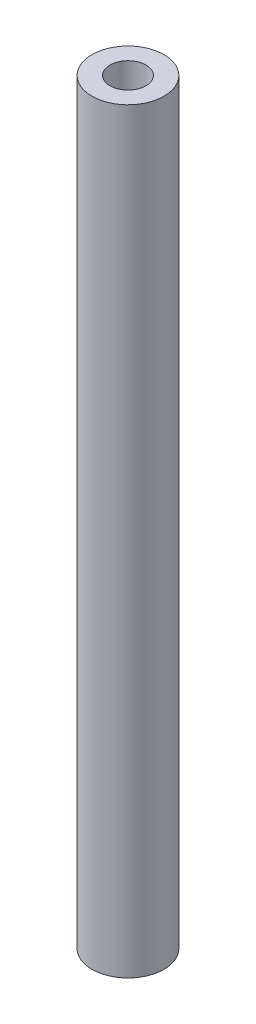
ISO-10303-21;
HEADER;
FILE_DESCRIPTION(('STEP AP214'),'2;1');
FILE_NAME('part.step','',(''),(''),'','','');
FILE_SCHEMA(('AUTOMOTIVE_DESIGN { 1 0 10303 214 1 1 1 1 }'));
ENDSEC;
DATA;
#1=APPLICATION_CONTEXT('core data for automotive mechanical design processes');
#2=APPLICATION_PROTOCOL_DEFINITION('international standard','automotive_design',2000,#1);
#3=PRODUCT_CONTEXT('',#1,'mechanical');
#4=PRODUCT('Part','Part','',(#3));
#5=PRODUCT_RELATED_PRODUCT_CATEGORY('part','',(#4));
#6=PRODUCT_DEFINITION_FORMATION('','',#4);
#7=PRODUCT_DEFINITION_CONTEXT('part definition',#1,'design');
#8=PRODUCT_DEFINITION('design','',#6,#7);
#9=PRODUCT_DEFINITION_SHAPE('','',#8);
#10=(LENGTH_UNIT() NAMED_UNIT(*) SI_UNIT(.MILLI.,.METRE.));
#11=(NAMED_UNIT(*) PLANE_ANGLE_UNIT() SI_UNIT($,.RADIAN.));
#12=(NAMED_UNIT(*) SI_UNIT($,.STERADIAN.) SOLID_ANGLE_UNIT());
#13=UNCERTAINTY_MEASURE_WITH_UNIT(LENGTH_MEASURE(1.E-05),#10,'distance_accuracy_value','');
#14=(GEOMETRIC_REPRESENTATION_CONTEXT(3) GLOBAL_UNCERTAINTY_ASSIGNED_CONTEXT((#13)) GLOBAL_UNIT_ASSIGNED_CONTEXT((#10,
#11,#12)) REPRESENTATION_CONTEXT('',''));
#15=CARTESIAN_POINT('',(0.,0.,0.));
#16=DIRECTION('',(0.,0.,1.));
#17=DIRECTION('',(1.,0.,0.));
#18=AXIS2_PLACEMENT_3D('',#15,#16,#17);
#19=CARTESIAN_POINT('',(0.,53.34,0.));
#20=DIRECTION('',(0.,1.,0.));
#21=DIRECTION('',(0.,0.,1.));
#22=AXIS2_PLACEMENT_3D('',#19,#20,#21);
#23=PLANE('',#22);
#24=CARTESIAN_POINT('',(0.,53.34,0.));
#25=DIRECTION('',(0.,1.,0.));
#26=DIRECTION('',(0.,0.,1.));
#27=AXIS2_PLACEMENT_3D('',#24,#25,#26);
#28=CIRCLE('',#27,2.54);
#29=CARTESIAN_POINT('',(0.,53.34,2.54));
#30=VERTEX_POINT('',#29);
#31=EDGE_CURVE('E10',#30,#30,#28,.T.);
#32=ORIENTED_EDGE('',*,*,#31,.T.);
#33=EDGE_LOOP('',(#32));
#34=FACE_BOUND('',#33,.T.);
#35=CARTESIAN_POINT('',(0.,53.34,0.));
#36=DIRECTION('',(0.,1.,0.));
#37=DIRECTION('',(0.,0.,1.));
#38=AXIS2_PLACEMENT_3D('',#35,#36,#37);
#39=CIRCLE('',#38,1.27);
#40=CARTESIAN_POINT('',(0.,53.34,1.27));
#41=VERTEX_POINT('',#40);
#42=EDGE_CURVE('E42',#41,#41,#39,.T.);
#43=ORIENTED_EDGE('',*,*,#42,.F.);
#44=EDGE_LOOP('',(#43));
#45=FACE_BOUND('',#44,.T.);
#46=ADVANCED_FACE('F31',(#34,#45),#23,.T.);
#47=CARTESIAN_POINT('',(0.,0.,0.));
#48=DIRECTION('',(0.,1.,0.));
#49=DIRECTION('',(0.,0.,1.));
#50=AXIS2_PLACEMENT_3D('',#47,#48,#49);
#51=PLANE('',#50);
#52=CARTESIAN_POINT('',(0.,0.,0.));
#53=DIRECTION('',(0.,1.,0.));
#54=DIRECTION('',(0.,0.,1.));
#55=AXIS2_PLACEMENT_3D('',#52,#53,#54);
#56=CIRCLE('',#55,2.54);
#57=CARTESIAN_POINT('',(0.,0.,2.54));
#58=VERTEX_POINT('',#57);
#59=EDGE_CURVE('E35',#58,#58,#56,.T.);
#60=ORIENTED_EDGE('',*,*,#59,.F.);
#61=EDGE_LOOP('',(#60));
#62=FACE_BOUND('',#61,.T.);
#63=CARTESIAN_POINT('',(0.,0.,0.));
#64=DIRECTION('',(0.,1.,0.));
#65=DIRECTION('',(0.,0.,1.));
#66=AXIS2_PLACEMENT_3D('',#63,#64,#65);
#67=CIRCLE('',#66,1.27);
#68=CARTESIAN_POINT('',(0.,0.,1.27));
#69=VERTEX_POINT('',#68);
#70=EDGE_CURVE('E44',#69,#69,#67,.T.);
#71=ORIENTED_EDGE('',*,*,#70,.T.);
#72=EDGE_LOOP('',(#71));
#73=FACE_BOUND('',#72,.T.);
#74=ADVANCED_FACE('F54',(#62,#73),#51,.F.);
#75=CARTESIAN_POINT('',(0.,53.34,0.));
#76=DIRECTION('',(0.,-1.,0.));
#77=DIRECTION('',(0.,0.,-1.));
#78=AXIS2_PLACEMENT_3D('',#75,#76,#77);
#79=CYLINDRICAL_SURFACE('',#78,2.54);
#80=ORIENTED_EDGE('',*,*,#31,.F.);
#81=EDGE_LOOP('',(#80));
#82=FACE_BOUND('',#81,.T.);
#83=ORIENTED_EDGE('',*,*,#59,.T.);
#84=EDGE_LOOP('',(#83));
#85=FACE_BOUND('',#84,.T.);
#86=ADVANCED_FACE('F33',(#82,#85),#79,.T.);
#87=CARTESIAN_POINT('',(0.,53.34,0.));
#88=DIRECTION('',(0.,-1.,0.));
#89=DIRECTION('',(0.,0.,-1.));
#90=AXIS2_PLACEMENT_3D('',#87,#88,#89);
#91=CYLINDRICAL_SURFACE('',#90,1.27);
#92=ORIENTED_EDGE('',*,*,#42,.T.);
#93=EDGE_LOOP('',(#92));
#94=FACE_BOUND('',#93,.T.);
#95=ORIENTED_EDGE('',*,*,#70,.F.);
#96=EDGE_LOOP('',(#95));
#97=FACE_BOUND('',#96,.T.);
#98=ADVANCED_FACE('F50',(#94,#97),#91,.F.);
#99=CLOSED_SHELL('',(#46,#74,#86,#98));
#100=MANIFOLD_SOLID_BREP('B2',#99);
#101=ADVANCED_BREP_SHAPE_REPRESENTATION('',(#18,#100),#14);
#102=SHAPE_DEFINITION_REPRESENTATION(#9,#101);
ENDSEC;
END-ISO-10303-21;
